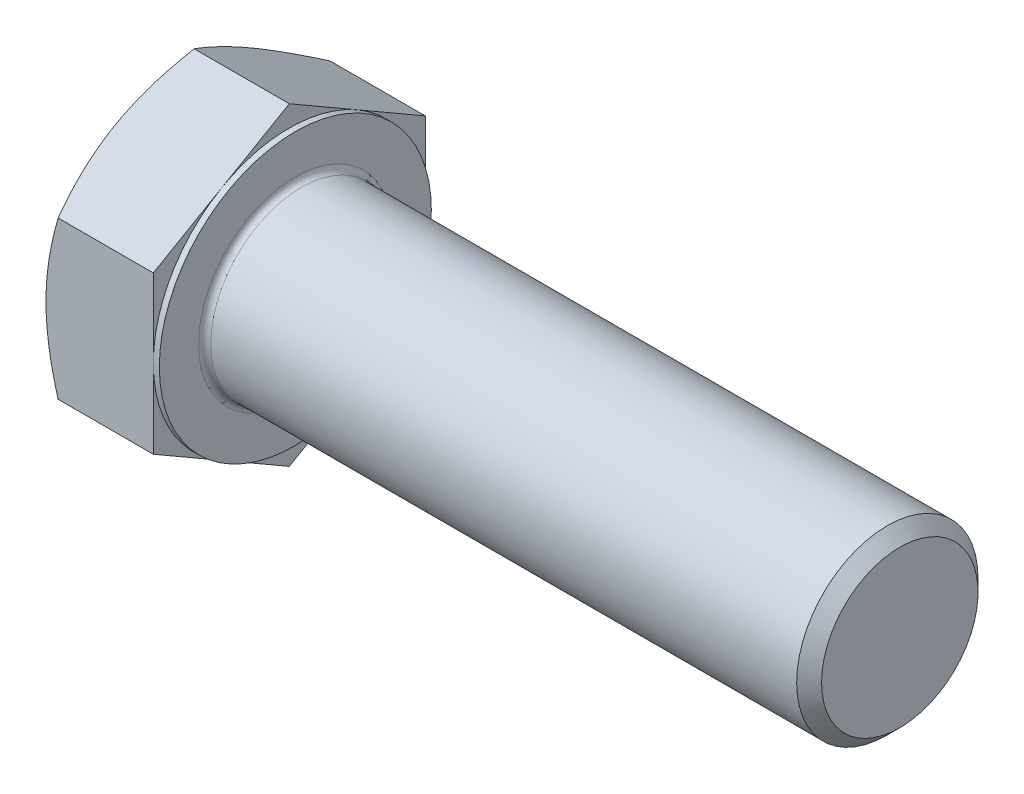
from build123d import *

# Parameters (mm, degrees)
BASEHEAD_DEPTH   = 15
BEARINGFACESKE_W = 0.8
BEARINGFACESKE_H = 2.784609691
FILLET_2_R       = 0.8


with BuildPart() as part:
    # BaseHeadSke → BaseHead (new body)
    with BuildSketch(Plane(origin=(0, 0, 0), x_dir=(0, 0, -1), z_dir=(1, 0, 0))):
        Polygon((18, 10.392304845), (0, 20.784609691), (-18, 10.392304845), (-18, -10.392304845), (0, -20.784609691), (18, -10.392304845), align=None)
    extrude(amount=BASEHEAD_DEPTH)

    # BodySke → BaseBody (revolve)
    with BuildSketch(Plane.XY, mode=Mode.PRIVATE) as basebody_sk:
        Polygon((0, 0), (95, 0), (95, 10.352), (93.352, 12), (0, 12), align=None)
    revolve(basebody_sk.sketch.rotate(Axis((0, 0, 0), (1, 0, 0)), 90), axis=Axis((0, 0, 0), (1, 0, 0)))

    # HeadChamferSke → HeadChamfer (revolve, cut)
    with BuildSketch(Plane.XY):
        Polygon((1.607695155, 20.784609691), (0, 20.784609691), (0, 18), align=None)
    revolve(axis=Axis((0, 0, 0), (1, 0, 0)), mode=Mode.SUBTRACT)

    # BearingFaceSke → BearingFace (revolve, cut)
    with BuildSketch(Plane.XY, mode=Mode.PRIVATE) as bearingface_sk:
        with Locations((14.6, 19.392304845)):
            Rectangle(BEARINGFACESKE_W, BEARINGFACESKE_H)
    revolve(bearingface_sk.sketch.rotate(Axis((0, 0, 0), (1, 0, 0)), 90), axis=Axis((0, 0, 0), (1, 0, 0)), mode=Mode.SUBTRACT)

    # Fillet 2
    fillet_2_edges = [part.edges().sort_by_distance(p)[0] for p in [
        (15, 0, -12),
    ]]
    fillet(fillet_2_edges, radius=FILLET_2_R)


solid = part.part
